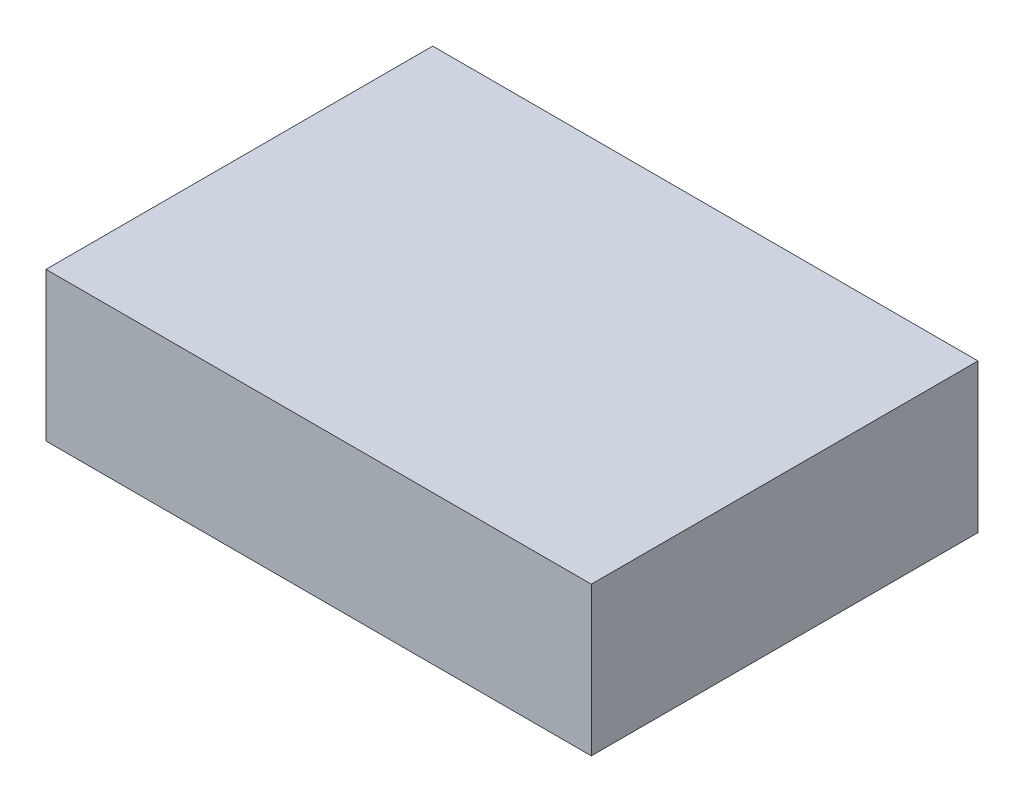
from build123d import *

# Parameters (mm, degrees)
SKETCH1_W           = 55
SKETCH1_H           = 39
BOSS_EXTRUDE1_DEPTH = 15


with BuildPart() as part:
    # Sketch1 → Boss-Extrude1 (new body)
    with BuildSketch(Plane(origin=(0, 0, 0), x_dir=(1, 0, 0), z_dir=(0, 1, 0))):
        Rectangle(SKETCH1_W, SKETCH1_H)
    extrude(amount=BOSS_EXTRUDE1_DEPTH)


solid = part.part
